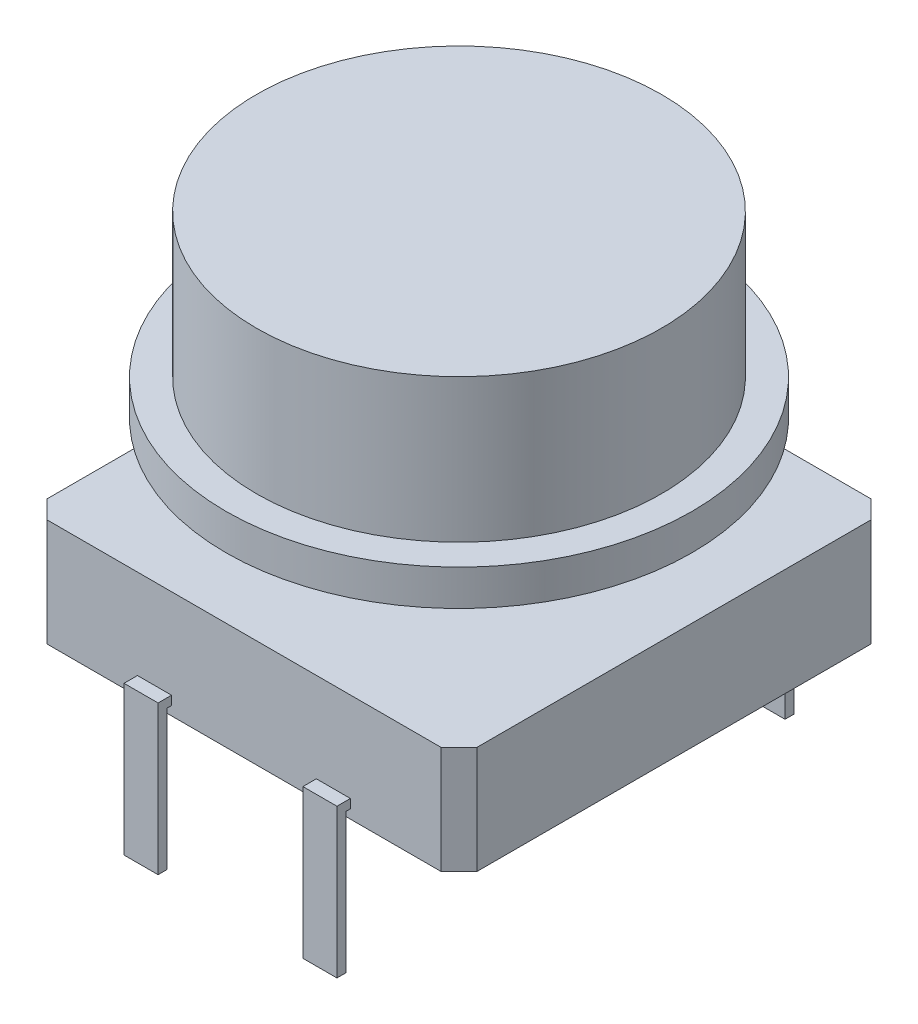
from build123d import *

# Parameters (mm, degrees)
BOSS_EXTRUDE1_DEPTH  = 3
SKETCH2_R            = 3.375
BOSS_EXTRUDE2_DEPTH  = 0.2
SKETCH3_W            = 3.5
SKETCH3_H            = 3.5
BOSS_EXTRUDE3_DEPTH  = 2
SKETCH4_R            = 6.5
BOSS_EXTRUDE4_DEPTH  = 1
SKETCH5_R            = 5.65
BOSS_EXTRUDE5_DEPTH  = 4
BOSS_EXTRUDE6_DEPTH  = 0.95
MIRROR2_COPY_1_DEPTH = 0.95


with BuildPart() as part:
    # Sketch1 → Boss-Extrude1 (new body)
    with BuildSketch(Plane(origin=(0, 0, 0), x_dir=(1, 0, 0), z_dir=(0, 1, 0))):
        Polygon((-5.5, 6), (-6, 5.5), (-6, -5.5), (-5.5, -6), (5.5, -6), (6, -5.5), (6, 5.5), (5.5, 6), align=None)
    extrude(amount=BOSS_EXTRUDE1_DEPTH)

    # Sketch2 → Boss-Extrude2 (add)
    with BuildSketch(Plane(origin=(0, 3, 0), x_dir=(1, 0, 0), z_dir=(0, 1, 0))):
        with Locations(Location((0, 0, 0), (0, 0, 270))):
            Circle(SKETCH2_R)
    extrude(amount=BOSS_EXTRUDE2_DEPTH)

    # Sketch3 → Boss-Extrude3 (add)
    with BuildSketch(Plane(origin=(0, 3.2, 0), x_dir=(1, 0, 0), z_dir=(0, 1, 0))):
        Rectangle(SKETCH3_W, SKETCH3_H)
    extrude(amount=BOSS_EXTRUDE3_DEPTH)

    # Sketch4 → Boss-Extrude4 (add)
    with BuildSketch(Plane(origin=(0, 5.2, 0), x_dir=(1, 0, 0), z_dir=(0, 1, 0))):
        with Locations(Location((0, 0, 0), (0, 0, 270))):
            Circle(SKETCH4_R)
    extrude(amount=BOSS_EXTRUDE4_DEPTH)

    # Sketch5 → Boss-Extrude5 (add)
    with BuildSketch(Plane(origin=(0, 6.2, 0), x_dir=(1, 0, 0), z_dir=(0, 1, 0))):
        with Locations(Location((0, 0, 0), (0, 0, 270))):
            Circle(SKETCH5_R)
    extrude(amount=BOSS_EXTRUDE5_DEPTH)

    # Sketch7 → Boss-Extrude6 (add)
    with BuildSketch(Plane.ZY.offset(2.97)):
        Polygon((6.375, 0.5), (6, 0.5), (6, 0.25), (6.125, 0.25), (6.125, -3.65), (6.375, -3.65), align=None)
    boss_extrude6 = extrude(amount=-BOSS_EXTRUDE6_DEPTH)

    # Mirror1: Boss-Extrude6 across plane
    add(boss_extrude6.mirror(Plane.ZY))

    # Mirror2: Boss-Extrude6 across plane
    add(boss_extrude6.mirror(Plane.XY))

    # Mirror2 copy 1 sketch → Mirror2 copy 1 (add)
    with BuildSketch(Plane(origin=(2.97, 0, 0), x_dir=(0, 0, -1), z_dir=(1, 0, 0))):
        Polygon((6.375, 0.5), (6, 0.5), (6, 0.25), (6.125, 0.25), (6.125, -3.65), (6.375, -3.65), align=None)
    extrude(amount=-MIRROR2_COPY_1_DEPTH)


solid = part.part
